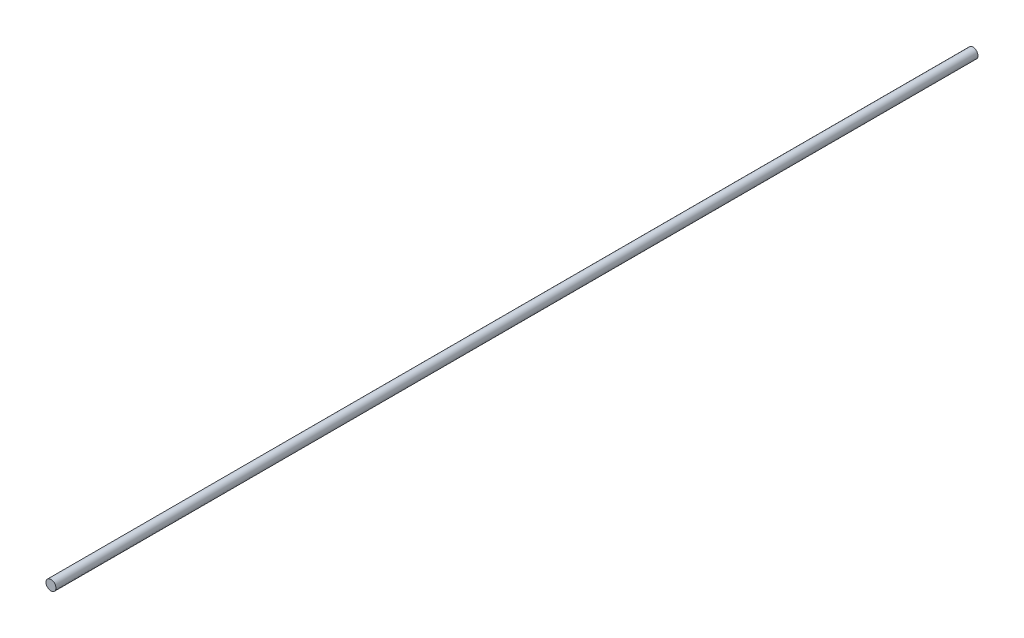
ISO-10303-21;
HEADER;
FILE_DESCRIPTION(('STEP AP214'),'2;1');
FILE_NAME('part.step','',(''),(''),'','','');
FILE_SCHEMA(('AUTOMOTIVE_DESIGN { 1 0 10303 214 1 1 1 1 }'));
ENDSEC;
DATA;
#1=APPLICATION_CONTEXT('core data for automotive mechanical design processes');
#2=APPLICATION_PROTOCOL_DEFINITION('international standard','automotive_design',2000,#1);
#3=PRODUCT_CONTEXT('',#1,'mechanical');
#4=PRODUCT('Part','Part','',(#3));
#5=PRODUCT_RELATED_PRODUCT_CATEGORY('part','',(#4));
#6=PRODUCT_DEFINITION_FORMATION('','',#4);
#7=PRODUCT_DEFINITION_CONTEXT('part definition',#1,'design');
#8=PRODUCT_DEFINITION('design','',#6,#7);
#9=PRODUCT_DEFINITION_SHAPE('','',#8);
#10=(LENGTH_UNIT() NAMED_UNIT(*) SI_UNIT(.MILLI.,.METRE.));
#11=(NAMED_UNIT(*) PLANE_ANGLE_UNIT() SI_UNIT($,.RADIAN.));
#12=(NAMED_UNIT(*) SI_UNIT($,.STERADIAN.) SOLID_ANGLE_UNIT());
#13=UNCERTAINTY_MEASURE_WITH_UNIT(LENGTH_MEASURE(1.E-05),#10,'distance_accuracy_value','');
#14=(GEOMETRIC_REPRESENTATION_CONTEXT(3) GLOBAL_UNCERTAINTY_ASSIGNED_CONTEXT((#13)) GLOBAL_UNIT_ASSIGNED_CONTEXT((#10,
#11,#12)) REPRESENTATION_CONTEXT('',''));
#15=CARTESIAN_POINT('',(0.,0.,0.));
#16=DIRECTION('',(0.,0.,1.));
#17=DIRECTION('',(1.,0.,0.));
#18=AXIS2_PLACEMENT_3D('',#15,#16,#17);
#19=CARTESIAN_POINT('',(0.,0.,-5550.));
#20=DIRECTION('',(0.,0.,1.));
#21=DIRECTION('',(1.,0.,0.));
#22=AXIS2_PLACEMENT_3D('',#19,#20,#21);
#23=CYLINDRICAL_SURFACE('',#22,30.);
#24=CARTESIAN_POINT('',(0.,0.,-5550.));
#25=DIRECTION('',(0.,0.,1.));
#26=DIRECTION('',(1.,0.,0.));
#27=AXIS2_PLACEMENT_3D('',#24,#25,#26);
#28=CIRCLE('',#27,30.);
#29=CARTESIAN_POINT('',(30.,0.,-5550.));
#30=VERTEX_POINT('',#29);
#31=EDGE_CURVE('E10',#30,#30,#28,.T.);
#32=ORIENTED_EDGE('',*,*,#31,.T.);
#33=EDGE_LOOP('',(#32));
#34=FACE_BOUND('',#33,.T.);
#35=CARTESIAN_POINT('',(0.,0.,0.));
#36=DIRECTION('',(0.,0.,1.));
#37=DIRECTION('',(1.,0.,0.));
#38=AXIS2_PLACEMENT_3D('',#35,#36,#37);
#39=CIRCLE('',#38,30.);
#40=CARTESIAN_POINT('',(30.,0.,0.));
#41=VERTEX_POINT('',#40);
#42=EDGE_CURVE('E40',#41,#41,#39,.T.);
#43=ORIENTED_EDGE('',*,*,#42,.F.);
#44=EDGE_LOOP('',(#43));
#45=FACE_BOUND('',#44,.T.);
#46=ADVANCED_FACE('F37',(#34,#45),#23,.T.);
#47=CARTESIAN_POINT('',(0.,0.,-5550.));
#48=DIRECTION('',(0.,0.,1.));
#49=DIRECTION('',(1.,0.,0.));
#50=AXIS2_PLACEMENT_3D('',#47,#48,#49);
#51=PLANE('',#50);
#52=ORIENTED_EDGE('',*,*,#31,.F.);
#53=EDGE_LOOP('',(#52));
#54=FACE_BOUND('',#53,.T.);
#55=ADVANCED_FACE('F54',(#54),#51,.F.);
#56=CARTESIAN_POINT('',(0.,0.,0.));
#57=DIRECTION('',(0.,0.,1.));
#58=DIRECTION('',(1.,0.,0.));
#59=AXIS2_PLACEMENT_3D('',#56,#57,#58);
#60=PLANE('',#59);
#61=ORIENTED_EDGE('',*,*,#42,.T.);
#62=EDGE_LOOP('',(#61));
#63=FACE_BOUND('',#62,.T.);
#64=ADVANCED_FACE('F51',(#63),#60,.T.);
#65=CLOSED_SHELL('',(#46,#55,#64));
#66=MANIFOLD_SOLID_BREP('B2',#65);
#67=ADVANCED_BREP_SHAPE_REPRESENTATION('',(#18,#66),#14);
#68=SHAPE_DEFINITION_REPRESENTATION(#9,#67);
ENDSEC;
END-ISO-10303-21;
